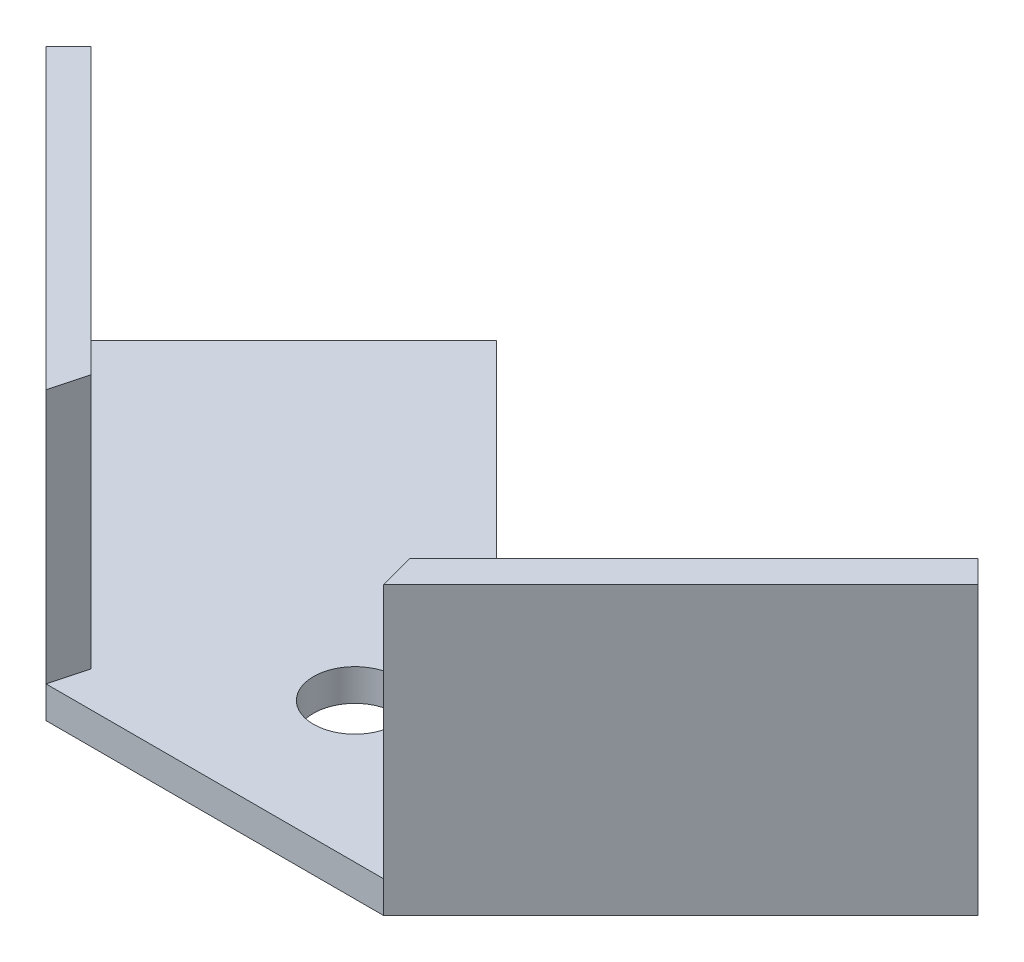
ISO-10303-21;
HEADER;
FILE_DESCRIPTION(('STEP AP214'),'2;1');
FILE_NAME('part.step','',(''),(''),'','','');
FILE_SCHEMA(('AUTOMOTIVE_DESIGN { 1 0 10303 214 1 1 1 1 }'));
ENDSEC;
DATA;
#1=APPLICATION_CONTEXT('core data for automotive mechanical design processes');
#2=APPLICATION_PROTOCOL_DEFINITION('international standard','automotive_design',2000,#1);
#3=PRODUCT_CONTEXT('',#1,'mechanical');
#4=PRODUCT('Part','Part','',(#3));
#5=PRODUCT_RELATED_PRODUCT_CATEGORY('part','',(#4));
#6=PRODUCT_DEFINITION_FORMATION('','',#4);
#7=PRODUCT_DEFINITION_CONTEXT('part definition',#1,'design');
#8=PRODUCT_DEFINITION('design','',#6,#7);
#9=PRODUCT_DEFINITION_SHAPE('','',#8);
#10=(LENGTH_UNIT() NAMED_UNIT(*) SI_UNIT(.MILLI.,.METRE.));
#11=(NAMED_UNIT(*) PLANE_ANGLE_UNIT() SI_UNIT($,.RADIAN.));
#12=(NAMED_UNIT(*) SI_UNIT($,.STERADIAN.) SOLID_ANGLE_UNIT());
#13=UNCERTAINTY_MEASURE_WITH_UNIT(LENGTH_MEASURE(1.E-05),#10,'distance_accuracy_value','');
#14=(GEOMETRIC_REPRESENTATION_CONTEXT(3) GLOBAL_UNCERTAINTY_ASSIGNED_CONTEXT((#13)) GLOBAL_UNIT_ASSIGNED_CONTEXT((#10,
#11,#12)) REPRESENTATION_CONTEXT('',''));
#15=CARTESIAN_POINT('',(0.,0.,0.));
#16=DIRECTION('',(0.,0.,1.));
#17=DIRECTION('',(1.,0.,0.));
#18=AXIS2_PLACEMENT_3D('',#15,#16,#17);
#19=CARTESIAN_POINT('',(0.,5.,0.));
#20=DIRECTION('',(0.,-1.,0.));
#21=DIRECTION('',(0.,0.,-1.));
#22=AXIS2_PLACEMENT_3D('',#19,#20,#21);
#23=PLANE('',#22);
#24=CARTESIAN_POINT('',(0.,5.,-22.));
#25=DIRECTION('',(0.,1.,0.));
#26=DIRECTION('',(0.,0.,1.));
#27=AXIS2_PLACEMENT_3D('',#24,#25,#26);
#28=CIRCLE('',#27,6.5);
#29=CARTESIAN_POINT('',(0.,5.,-15.5));
#30=VERTEX_POINT('',#29);
#31=EDGE_CURVE('E180',#30,#30,#28,.T.);
#32=ORIENTED_EDGE('',*,*,#31,.F.);
#33=EDGE_LOOP('',(#32));
#34=FACE_BOUND('',#33,.T.);
#35=DIRECTION('',(-0.707106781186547,0.,0.707106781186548));
#36=VECTOR('',#35,1.);
#37=CARTESIAN_POINT('',(25.0057075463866,5.,-5.57677535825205));
#38=LINE('',#37,#36);
#39=CARTESIAN_POINT('',(69.6335136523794,4.99999999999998,-50.2045814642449));
#40=VERTEX_POINT('',#39);
#41=CARTESIAN_POINT('',(25.0057075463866,5.,-5.57677535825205));
#42=VERTEX_POINT('',#41);
#43=EDGE_CURVE('E150',#40,#42,#38,.T.);
#44=ORIENTED_EDGE('',*,*,#43,.F.);
#45=DIRECTION('',(-0.707106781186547,0.,-0.707106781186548));
#46=VECTOR('',#45,1.);
#47=CARTESIAN_POINT('',(73.1690475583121,4.99999999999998,-46.6690475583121));
#48=LINE('',#47,#46);
#49=CARTESIAN_POINT('',(37.8137084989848,4.99999999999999,-82.0243866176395));
#50=VERTEX_POINT('',#49);
#51=EDGE_CURVE('E188',#40,#50,#48,.T.);
#52=ORIENTED_EDGE('',*,*,#51,.T.);
#53=DIRECTION('',(-0.707106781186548,0.,0.707106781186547));
#54=VECTOR('',#53,1.);
#55=CARTESIAN_POINT('',(37.8137084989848,4.99999999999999,-82.0243866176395));
#56=LINE('',#55,#54);
#57=CARTESIAN_POINT('',(0.,5.,-44.2106781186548));
#58=VERTEX_POINT('',#57);
#59=EDGE_CURVE('E191',#50,#58,#56,.T.);
#60=ORIENTED_EDGE('',*,*,#59,.T.);
#61=DIRECTION('',(-0.707106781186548,0.,-0.707106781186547));
#62=VECTOR('',#61,1.);
#63=CARTESIAN_POINT('',(-37.8137084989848,5.,-82.0243866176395));
#64=LINE('',#63,#62);
#65=CARTESIAN_POINT('',(-37.8137084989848,5.,-82.0243866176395));
#66=VERTEX_POINT('',#65);
#67=EDGE_CURVE('E193',#58,#66,#64,.T.);
#68=ORIENTED_EDGE('',*,*,#67,.T.);
#69=DIRECTION('',(-0.707106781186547,0.,0.707106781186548));
#70=VECTOR('',#69,1.);
#71=CARTESIAN_POINT('',(-73.1690475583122,5.00000000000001,-46.6690475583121));
#72=LINE('',#71,#70);
#73=CARTESIAN_POINT('',(-69.6335136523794,5.00000000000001,-50.2045814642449));
#74=VERTEX_POINT('',#73);
#75=EDGE_CURVE('E61',#66,#74,#72,.T.);
#76=ORIENTED_EDGE('',*,*,#75,.T.);
#77=DIRECTION('',(-0.707106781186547,0.,-0.707106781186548));
#78=VECTOR('',#77,1.);
#79=CARTESIAN_POINT('',(-25.0057075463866,5.,-5.57677535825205));
#80=LINE('',#79,#78);
#81=CARTESIAN_POINT('',(-25.0057075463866,5.,-5.57677535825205));
#82=VERTEX_POINT('',#81);
#83=EDGE_CURVE('E154',#82,#74,#80,.T.);
#84=ORIENTED_EDGE('',*,*,#83,.F.);
#85=DIRECTION('',(0.258819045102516,0.,-0.96592582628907));
#86=VECTOR('',#85,1.);
#87=CARTESIAN_POINT('',(-26.5,5.,0.));
#88=LINE('',#87,#86);
#89=CARTESIAN_POINT('',(-26.5,5.,0.));
#90=VERTEX_POINT('',#89);
#91=EDGE_CURVE('E151',#90,#82,#88,.T.);
#92=ORIENTED_EDGE('',*,*,#91,.F.);
#93=DIRECTION('',(1.,0.,0.));
#94=VECTOR('',#93,1.);
#95=CARTESIAN_POINT('',(26.5,5.,0.));
#96=LINE('',#95,#94);
#97=CARTESIAN_POINT('',(26.5,5.,0.));
#98=VERTEX_POINT('',#97);
#99=EDGE_CURVE('E186',#90,#98,#96,.T.);
#100=ORIENTED_EDGE('',*,*,#99,.T.);
#101=DIRECTION('',(0.258819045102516,0.,0.96592582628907));
#102=VECTOR('',#101,1.);
#103=CARTESIAN_POINT('',(26.5,5.,0.));
#104=LINE('',#103,#102);
#105=EDGE_CURVE('E54',#42,#98,#104,.T.);
#106=ORIENTED_EDGE('',*,*,#105,.F.);
#107=EDGE_LOOP('',(#44,#52,#60,#68,#76,#84,#92,#100,#106));
#108=FACE_BOUND('',#107,.T.);
#109=ADVANCED_FACE('F39',(#34,#108),#23,.F.);
#110=CARTESIAN_POINT('',(0.,0.,0.));
#111=DIRECTION('',(0.,-1.,0.));
#112=DIRECTION('',(0.,0.,-1.));
#113=AXIS2_PLACEMENT_3D('',#110,#111,#112);
#114=PLANE('',#113);
#115=DIRECTION('',(0.707106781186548,0.,0.707106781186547));
#116=VECTOR('',#115,1.);
#117=CARTESIAN_POINT('',(-26.5,0.,0.));
#118=LINE('',#117,#116);
#119=CARTESIAN_POINT('',(-73.1690475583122,0.,-46.6690475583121));
#120=VERTEX_POINT('',#119);
#121=CARTESIAN_POINT('',(-26.5,0.,0.));
#122=VERTEX_POINT('',#121);
#123=EDGE_CURVE('E183',#120,#122,#118,.T.);
#124=ORIENTED_EDGE('',*,*,#123,.F.);
#125=DIRECTION('',(-0.707106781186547,0.,0.707106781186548));
#126=VECTOR('',#125,1.);
#127=CARTESIAN_POINT('',(-73.1690475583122,0.,-46.6690475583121));
#128=LINE('',#127,#126);
#129=CARTESIAN_POINT('',(-37.8137084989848,0.,-82.0243866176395));
#130=VERTEX_POINT('',#129);
#131=EDGE_CURVE('E189',#130,#120,#128,.T.);
#132=ORIENTED_EDGE('',*,*,#131,.F.);
#133=DIRECTION('',(-0.707106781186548,0.,-0.707106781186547));
#134=VECTOR('',#133,1.);
#135=CARTESIAN_POINT('',(-37.8137084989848,0.,-82.0243866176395));
#136=LINE('',#135,#134);
#137=CARTESIAN_POINT('',(0.,0.,-44.2106781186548));
#138=VERTEX_POINT('',#137);
#139=EDGE_CURVE('E207',#138,#130,#136,.T.);
#140=ORIENTED_EDGE('',*,*,#139,.F.);
#141=DIRECTION('',(-0.707106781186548,0.,0.707106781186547));
#142=VECTOR('',#141,1.);
#143=CARTESIAN_POINT('',(37.8137084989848,0.,-82.0243866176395));
#144=LINE('',#143,#142);
#145=CARTESIAN_POINT('',(37.8137084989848,0.,-82.0243866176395));
#146=VERTEX_POINT('',#145);
#147=EDGE_CURVE('E205',#146,#138,#144,.T.);
#148=ORIENTED_EDGE('',*,*,#147,.F.);
#149=DIRECTION('',(-0.707106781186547,0.,-0.707106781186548));
#150=VECTOR('',#149,1.);
#151=CARTESIAN_POINT('',(73.1690475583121,0.,-46.6690475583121));
#152=LINE('',#151,#150);
#153=CARTESIAN_POINT('',(73.1690475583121,0.,-46.6690475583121));
#154=VERTEX_POINT('',#153);
#155=EDGE_CURVE('E203',#154,#146,#152,.T.);
#156=ORIENTED_EDGE('',*,*,#155,.F.);
#157=DIRECTION('',(0.707106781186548,0.,-0.707106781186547));
#158=VECTOR('',#157,1.);
#159=CARTESIAN_POINT('',(26.5,0.,0.));
#160=LINE('',#159,#158);
#161=CARTESIAN_POINT('',(26.5,0.,0.));
#162=VERTEX_POINT('',#161);
#163=EDGE_CURVE('E201',#162,#154,#160,.T.);
#164=ORIENTED_EDGE('',*,*,#163,.F.);
#165=DIRECTION('',(1.,0.,0.));
#166=VECTOR('',#165,1.);
#167=CARTESIAN_POINT('',(26.5,0.,0.));
#168=LINE('',#167,#166);
#169=EDGE_CURVE('E199',#122,#162,#168,.T.);
#170=ORIENTED_EDGE('',*,*,#169,.F.);
#171=EDGE_LOOP('',(#124,#132,#140,#148,#156,#164,#170));
#172=FACE_BOUND('',#171,.T.);
#173=CARTESIAN_POINT('',(0.,0.,-22.));
#174=DIRECTION('',(0.,1.,0.));
#175=DIRECTION('',(0.,0.,1.));
#176=AXIS2_PLACEMENT_3D('',#173,#174,#175);
#177=CIRCLE('',#176,6.5);
#178=CARTESIAN_POINT('',(0.,0.,-15.5));
#179=VERTEX_POINT('',#178);
#180=EDGE_CURVE('E179',#179,#179,#177,.T.);
#181=ORIENTED_EDGE('',*,*,#180,.T.);
#182=EDGE_LOOP('',(#181));
#183=FACE_BOUND('',#182,.T.);
#184=ADVANCED_FACE('F233',(#172,#183),#114,.T.);
#185=CARTESIAN_POINT('',(-26.5,5.,0.));
#186=DIRECTION('',(0.707106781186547,0.,-0.707106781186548));
#187=DIRECTION('',(-0.707106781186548,0.,-0.707106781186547));
#188=AXIS2_PLACEMENT_3D('',#185,#186,#187);
#189=PLANE('',#188);
#190=ORIENTED_EDGE('',*,*,#123,.T.);
#191=DIRECTION('',(0.,-1.,0.));
#192=VECTOR('',#191,1.);
#193=CARTESIAN_POINT('',(-26.5,5.,0.));
#194=LINE('',#193,#192);
#195=EDGE_CURVE('E11',#90,#122,#194,.T.);
#196=ORIENTED_EDGE('',*,*,#195,.F.);
#197=DIRECTION('',(0.,-1.,0.));
#198=VECTOR('',#197,1.);
#199=CARTESIAN_POINT('',(-26.5,45.,0.));
#200=LINE('',#199,#198);
#201=CARTESIAN_POINT('',(-26.5,45.,0.));
#202=VERTEX_POINT('',#201);
#203=EDGE_CURVE('E176',#202,#90,#200,.T.);
#204=ORIENTED_EDGE('',*,*,#203,.F.);
#205=DIRECTION('',(0.707106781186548,0.,0.707106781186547));
#206=VECTOR('',#205,1.);
#207=CARTESIAN_POINT('',(-73.1690475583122,45.,-46.6690475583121));
#208=LINE('',#207,#206);
#209=CARTESIAN_POINT('',(-73.1690475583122,45.,-46.6690475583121));
#210=VERTEX_POINT('',#209);
#211=EDGE_CURVE('E163',#210,#202,#208,.T.);
#212=ORIENTED_EDGE('',*,*,#211,.F.);
#213=DIRECTION('',(0.,-1.,0.));
#214=VECTOR('',#213,1.);
#215=CARTESIAN_POINT('',(-73.1690475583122,5.00000000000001,-46.6690475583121));
#216=LINE('',#215,#214);
#217=EDGE_CURVE('E196',#210,#120,#216,.T.);
#218=ORIENTED_EDGE('',*,*,#217,.T.);
#219=EDGE_LOOP('',(#190,#196,#204,#212,#218));
#220=FACE_BOUND('',#219,.T.);
#221=ADVANCED_FACE('F41',(#220),#189,.F.);
#222=CARTESIAN_POINT('',(26.5,5.,0.));
#223=DIRECTION('',(0.,0.,-1.));
#224=DIRECTION('',(-1.,0.,0.));
#225=AXIS2_PLACEMENT_3D('',#222,#223,#224);
#226=PLANE('',#225);
#227=ORIENTED_EDGE('',*,*,#169,.T.);
#228=DIRECTION('',(0.,-1.,0.));
#229=VECTOR('',#228,1.);
#230=CARTESIAN_POINT('',(26.5,5.,0.));
#231=LINE('',#230,#229);
#232=EDGE_CURVE('E47',#98,#162,#231,.T.);
#233=ORIENTED_EDGE('',*,*,#232,.F.);
#234=ORIENTED_EDGE('',*,*,#99,.F.);
#235=ORIENTED_EDGE('',*,*,#195,.T.);
#236=EDGE_LOOP('',(#227,#233,#234,#235));
#237=FACE_BOUND('',#236,.T.);
#238=ADVANCED_FACE('F268',(#237),#226,.F.);
#239=CARTESIAN_POINT('',(26.5,5.,0.));
#240=DIRECTION('',(-0.707106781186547,0.,-0.707106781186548));
#241=DIRECTION('',(-0.707106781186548,0.,0.707106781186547));
#242=AXIS2_PLACEMENT_3D('',#239,#240,#241);
#243=PLANE('',#242);
#244=ORIENTED_EDGE('',*,*,#163,.T.);
#245=DIRECTION('',(0.,-1.,0.));
#246=VECTOR('',#245,1.);
#247=CARTESIAN_POINT('',(73.1690475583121,4.99999999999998,-46.6690475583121));
#248=LINE('',#247,#246);
#249=CARTESIAN_POINT('',(73.1690475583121,45.,-46.6690475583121));
#250=VERTEX_POINT('',#249);
#251=EDGE_CURVE('E221',#250,#154,#248,.T.);
#252=ORIENTED_EDGE('',*,*,#251,.F.);
#253=DIRECTION('',(0.707106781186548,0.,-0.707106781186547));
#254=VECTOR('',#253,1.);
#255=CARTESIAN_POINT('',(73.1690475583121,45.,-46.6690475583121));
#256=LINE('',#255,#254);
#257=CARTESIAN_POINT('',(26.5,45.,0.));
#258=VERTEX_POINT('',#257);
#259=EDGE_CURVE('E138',#258,#250,#256,.T.);
#260=ORIENTED_EDGE('',*,*,#259,.F.);
#261=DIRECTION('',(0.,-1.,0.));
#262=VECTOR('',#261,1.);
#263=CARTESIAN_POINT('',(26.5,45.,0.));
#264=LINE('',#263,#262);
#265=EDGE_CURVE('E134',#258,#98,#264,.T.);
#266=ORIENTED_EDGE('',*,*,#265,.T.);
#267=ORIENTED_EDGE('',*,*,#232,.T.);
#268=EDGE_LOOP('',(#244,#252,#260,#266,#267));
#269=FACE_BOUND('',#268,.T.);
#270=ADVANCED_FACE('F227',(#269),#243,.F.);
#271=CARTESIAN_POINT('',(73.1690475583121,4.99999999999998,-46.6690475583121));
#272=DIRECTION('',(-0.707106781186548,0.,0.707106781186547));
#273=DIRECTION('',(0.707106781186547,0.,0.707106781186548));
#274=AXIS2_PLACEMENT_3D('',#271,#272,#273);
#275=PLANE('',#274);
#276=ORIENTED_EDGE('',*,*,#155,.T.);
#277=DIRECTION('',(0.,-1.,0.));
#278=VECTOR('',#277,1.);
#279=CARTESIAN_POINT('',(37.8137084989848,4.99999999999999,-82.0243866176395));
#280=LINE('',#279,#278);
#281=EDGE_CURVE('E218',#50,#146,#280,.T.);
#282=ORIENTED_EDGE('',*,*,#281,.F.);
#283=ORIENTED_EDGE('',*,*,#51,.F.);
#284=DIRECTION('',(0.,-1.,0.));
#285=VECTOR('',#284,1.);
#286=CARTESIAN_POINT('',(69.6335136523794,45.,-50.2045814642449));
#287=LINE('',#286,#285);
#288=CARTESIAN_POINT('',(69.6335136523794,45.,-50.2045814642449));
#289=VERTEX_POINT('',#288);
#290=EDGE_CURVE('E156',#289,#40,#287,.T.);
#291=ORIENTED_EDGE('',*,*,#290,.F.);
#292=DIRECTION('',(-0.707106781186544,0.,-0.707106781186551));
#293=VECTOR('',#292,1.);
#294=CARTESIAN_POINT('',(69.6335136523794,45.,-50.2045814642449));
#295=LINE('',#294,#293);
#296=EDGE_CURVE('E144',#250,#289,#295,.T.);
#297=ORIENTED_EDGE('',*,*,#296,.F.);
#298=ORIENTED_EDGE('',*,*,#251,.T.);
#299=EDGE_LOOP('',(#276,#282,#283,#291,#297,#298));
#300=FACE_BOUND('',#299,.T.);
#301=ADVANCED_FACE('F239',(#300),#275,.F.);
#302=CARTESIAN_POINT('',(37.8137084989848,4.99999999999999,-82.0243866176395));
#303=DIRECTION('',(0.707106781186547,0.,0.707106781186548));
#304=DIRECTION('',(0.707106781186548,0.,-0.707106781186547));
#305=AXIS2_PLACEMENT_3D('',#302,#303,#304);
#306=PLANE('',#305);
#307=ORIENTED_EDGE('',*,*,#147,.T.);
#308=DIRECTION('',(0.,-1.,0.));
#309=VECTOR('',#308,1.);
#310=CARTESIAN_POINT('',(0.,5.,-44.2106781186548));
#311=LINE('',#310,#309);
#312=EDGE_CURVE('E215',#58,#138,#311,.T.);
#313=ORIENTED_EDGE('',*,*,#312,.F.);
#314=ORIENTED_EDGE('',*,*,#59,.F.);
#315=ORIENTED_EDGE('',*,*,#281,.T.);
#316=EDGE_LOOP('',(#307,#313,#314,#315));
#317=FACE_BOUND('',#316,.T.);
#318=ADVANCED_FACE('F242',(#317),#306,.F.);
#319=CARTESIAN_POINT('',(-37.8137084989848,5.,-82.0243866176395));
#320=DIRECTION('',(-0.707106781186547,0.,0.707106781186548));
#321=DIRECTION('',(0.707106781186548,0.,0.707106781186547));
#322=AXIS2_PLACEMENT_3D('',#319,#320,#321);
#323=PLANE('',#322);
#324=ORIENTED_EDGE('',*,*,#139,.T.);
#325=DIRECTION('',(0.,-1.,0.));
#326=VECTOR('',#325,1.);
#327=CARTESIAN_POINT('',(-37.8137084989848,5.,-82.0243866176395));
#328=LINE('',#327,#326);
#329=EDGE_CURVE('E212',#66,#130,#328,.T.);
#330=ORIENTED_EDGE('',*,*,#329,.F.);
#331=ORIENTED_EDGE('',*,*,#67,.F.);
#332=ORIENTED_EDGE('',*,*,#312,.T.);
#333=EDGE_LOOP('',(#324,#330,#331,#332));
#334=FACE_BOUND('',#333,.T.);
#335=ADVANCED_FACE('F251',(#334),#323,.F.);
#336=CARTESIAN_POINT('',(-73.1690475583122,5.00000000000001,-46.6690475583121));
#337=DIRECTION('',(0.707106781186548,0.,0.707106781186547));
#338=DIRECTION('',(0.707106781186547,0.,-0.707106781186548));
#339=AXIS2_PLACEMENT_3D('',#336,#337,#338);
#340=PLANE('',#339);
#341=ORIENTED_EDGE('',*,*,#131,.T.);
#342=ORIENTED_EDGE('',*,*,#217,.F.);
#343=DIRECTION('',(-0.707106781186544,0.,0.707106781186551));
#344=VECTOR('',#343,1.);
#345=CARTESIAN_POINT('',(-69.6335136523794,45.,-50.2045814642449));
#346=LINE('',#345,#344);
#347=CARTESIAN_POINT('',(-69.6335136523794,45.,-50.2045814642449));
#348=VERTEX_POINT('',#347);
#349=EDGE_CURVE('E160',#348,#210,#346,.T.);
#350=ORIENTED_EDGE('',*,*,#349,.F.);
#351=DIRECTION('',(0.,-1.,0.));
#352=VECTOR('',#351,1.);
#353=CARTESIAN_POINT('',(-69.6335136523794,45.,-50.2045814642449));
#354=LINE('',#353,#352);
#355=EDGE_CURVE('E168',#348,#74,#354,.T.);
#356=ORIENTED_EDGE('',*,*,#355,.T.);
#357=ORIENTED_EDGE('',*,*,#75,.F.);
#358=ORIENTED_EDGE('',*,*,#329,.T.);
#359=EDGE_LOOP('',(#341,#342,#350,#356,#357,#358));
#360=FACE_BOUND('',#359,.T.);
#361=ADVANCED_FACE('F254',(#360),#340,.F.);
#362=CARTESIAN_POINT('',(0.,5.,-22.));
#363=DIRECTION('',(0.,-1.,0.));
#364=DIRECTION('',(0.,0.,-1.));
#365=AXIS2_PLACEMENT_3D('',#362,#363,#364);
#366=CYLINDRICAL_SURFACE('',#365,6.5);
#367=ORIENTED_EDGE('',*,*,#31,.T.);
#368=EDGE_LOOP('',(#367));
#369=FACE_BOUND('',#368,.T.);
#370=ORIENTED_EDGE('',*,*,#180,.F.);
#371=EDGE_LOOP('',(#370));
#372=FACE_BOUND('',#371,.T.);
#373=ADVANCED_FACE('F284',(#369,#372),#366,.F.);
#374=CARTESIAN_POINT('',(-26.5,45.,0.));
#375=DIRECTION('',(-0.96592582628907,0.,-0.258819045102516));
#376=DIRECTION('',(-0.258819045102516,0.,0.96592582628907));
#377=AXIS2_PLACEMENT_3D('',#374,#375,#376);
#378=PLANE('',#377);
#379=ORIENTED_EDGE('',*,*,#91,.T.);
#380=DIRECTION('',(0.,-1.,0.));
#381=VECTOR('',#380,1.);
#382=CARTESIAN_POINT('',(-25.0057075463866,45.,-5.57677535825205));
#383=LINE('',#382,#381);
#384=CARTESIAN_POINT('',(-25.0057075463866,45.,-5.57677535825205));
#385=VERTEX_POINT('',#384);
#386=EDGE_CURVE('E173',#385,#82,#383,.T.);
#387=ORIENTED_EDGE('',*,*,#386,.F.);
#388=DIRECTION('',(0.258819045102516,0.,-0.96592582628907));
#389=VECTOR('',#388,1.);
#390=CARTESIAN_POINT('',(-26.5,45.,0.));
#391=LINE('',#390,#389);
#392=EDGE_CURVE('E165',#202,#385,#391,.T.);
#393=ORIENTED_EDGE('',*,*,#392,.F.);
#394=ORIENTED_EDGE('',*,*,#203,.T.);
#395=EDGE_LOOP('',(#379,#387,#393,#394));
#396=FACE_BOUND('',#395,.T.);
#397=ADVANCED_FACE('F262',(#396),#378,.F.);
#398=CARTESIAN_POINT('',(-25.0057075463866,45.,-5.57677535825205));
#399=DIRECTION('',(-0.707106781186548,0.,0.707106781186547));
#400=DIRECTION('',(0.707106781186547,0.,0.707106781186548));
#401=AXIS2_PLACEMENT_3D('',#398,#399,#400);
#402=PLANE('',#401);
#403=ORIENTED_EDGE('',*,*,#83,.T.);
#404=ORIENTED_EDGE('',*,*,#355,.F.);
#405=DIRECTION('',(-0.707106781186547,0.,-0.707106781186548));
#406=VECTOR('',#405,1.);
#407=CARTESIAN_POINT('',(-25.0057075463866,45.,-5.57677535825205));
#408=LINE('',#407,#406);
#409=EDGE_CURVE('E167',#385,#348,#408,.T.);
#410=ORIENTED_EDGE('',*,*,#409,.F.);
#411=ORIENTED_EDGE('',*,*,#386,.T.);
#412=EDGE_LOOP('',(#403,#404,#410,#411));
#413=FACE_BOUND('',#412,.T.);
#414=ADVANCED_FACE('F259',(#413),#402,.F.);
#415=CARTESIAN_POINT('',(0.,45.,0.));
#416=DIRECTION('',(0.,1.,0.));
#417=DIRECTION('',(0.,0.,1.));
#418=AXIS2_PLACEMENT_3D('',#415,#416,#417);
#419=PLANE('',#418);
#420=ORIENTED_EDGE('',*,*,#349,.T.);
#421=ORIENTED_EDGE('',*,*,#211,.T.);
#422=ORIENTED_EDGE('',*,*,#392,.T.);
#423=ORIENTED_EDGE('',*,*,#409,.T.);
#424=EDGE_LOOP('',(#420,#421,#422,#423));
#425=FACE_BOUND('',#424,.T.);
#426=ADVANCED_FACE('F327',(#425),#419,.T.);
#427=CARTESIAN_POINT('',(25.0057075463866,45.,-5.57677535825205));
#428=DIRECTION('',(0.707106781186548,0.,0.707106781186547));
#429=DIRECTION('',(0.707106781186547,0.,-0.707106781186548));
#430=AXIS2_PLACEMENT_3D('',#427,#428,#429);
#431=PLANE('',#430);
#432=ORIENTED_EDGE('',*,*,#43,.T.);
#433=DIRECTION('',(0.,-1.,0.));
#434=VECTOR('',#433,1.);
#435=CARTESIAN_POINT('',(25.0057075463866,45.,-5.57677535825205));
#436=LINE('',#435,#434);
#437=CARTESIAN_POINT('',(25.0057075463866,45.,-5.57677535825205));
#438=VERTEX_POINT('',#437);
#439=EDGE_CURVE('E131',#438,#42,#436,.T.);
#440=ORIENTED_EDGE('',*,*,#439,.F.);
#441=DIRECTION('',(-0.707106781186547,0.,0.707106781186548));
#442=VECTOR('',#441,1.);
#443=CARTESIAN_POINT('',(25.0057075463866,45.,-5.57677535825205));
#444=LINE('',#443,#442);
#445=EDGE_CURVE('E139',#289,#438,#444,.T.);
#446=ORIENTED_EDGE('',*,*,#445,.F.);
#447=ORIENTED_EDGE('',*,*,#290,.T.);
#448=EDGE_LOOP('',(#432,#440,#446,#447));
#449=FACE_BOUND('',#448,.T.);
#450=ADVANCED_FACE('F149',(#449),#431,.F.);
#451=CARTESIAN_POINT('',(26.5,45.,0.));
#452=DIRECTION('',(0.96592582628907,0.,-0.258819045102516));
#453=DIRECTION('',(-0.258819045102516,0.,-0.96592582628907));
#454=AXIS2_PLACEMENT_3D('',#451,#452,#453);
#455=PLANE('',#454);
#456=ORIENTED_EDGE('',*,*,#105,.T.);
#457=ORIENTED_EDGE('',*,*,#265,.F.);
#458=DIRECTION('',(0.258819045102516,0.,0.96592582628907));
#459=VECTOR('',#458,1.);
#460=CARTESIAN_POINT('',(26.5,45.,0.));
#461=LINE('',#460,#459);
#462=EDGE_CURVE('E127',#438,#258,#461,.T.);
#463=ORIENTED_EDGE('',*,*,#462,.F.);
#464=ORIENTED_EDGE('',*,*,#439,.T.);
#465=EDGE_LOOP('',(#456,#457,#463,#464));
#466=FACE_BOUND('',#465,.T.);
#467=ADVANCED_FACE('F129',(#466),#455,.F.);
#468=CARTESIAN_POINT('',(0.,45.,0.));
#469=DIRECTION('',(0.,-1.,0.));
#470=DIRECTION('',(0.,0.,-1.));
#471=AXIS2_PLACEMENT_3D('',#468,#469,#470);
#472=PLANE('',#471);
#473=ORIENTED_EDGE('',*,*,#445,.T.);
#474=ORIENTED_EDGE('',*,*,#462,.T.);
#475=ORIENTED_EDGE('',*,*,#259,.T.);
#476=ORIENTED_EDGE('',*,*,#296,.T.);
#477=EDGE_LOOP('',(#473,#474,#475,#476));
#478=FACE_BOUND('',#477,.T.);
#479=ADVANCED_FACE('F142',(#478),#472,.F.);
#480=CLOSED_SHELL('',(#109,#184,#221,#238,#270,#301,#318,#335,#361,#373,#397,#414,#426,#450,
#467,#479));
#481=MANIFOLD_SOLID_BREP('B2',#480);
#482=ADVANCED_BREP_SHAPE_REPRESENTATION('',(#18,#481),#14);
#483=SHAPE_DEFINITION_REPRESENTATION(#9,#482);
ENDSEC;
END-ISO-10303-21;
